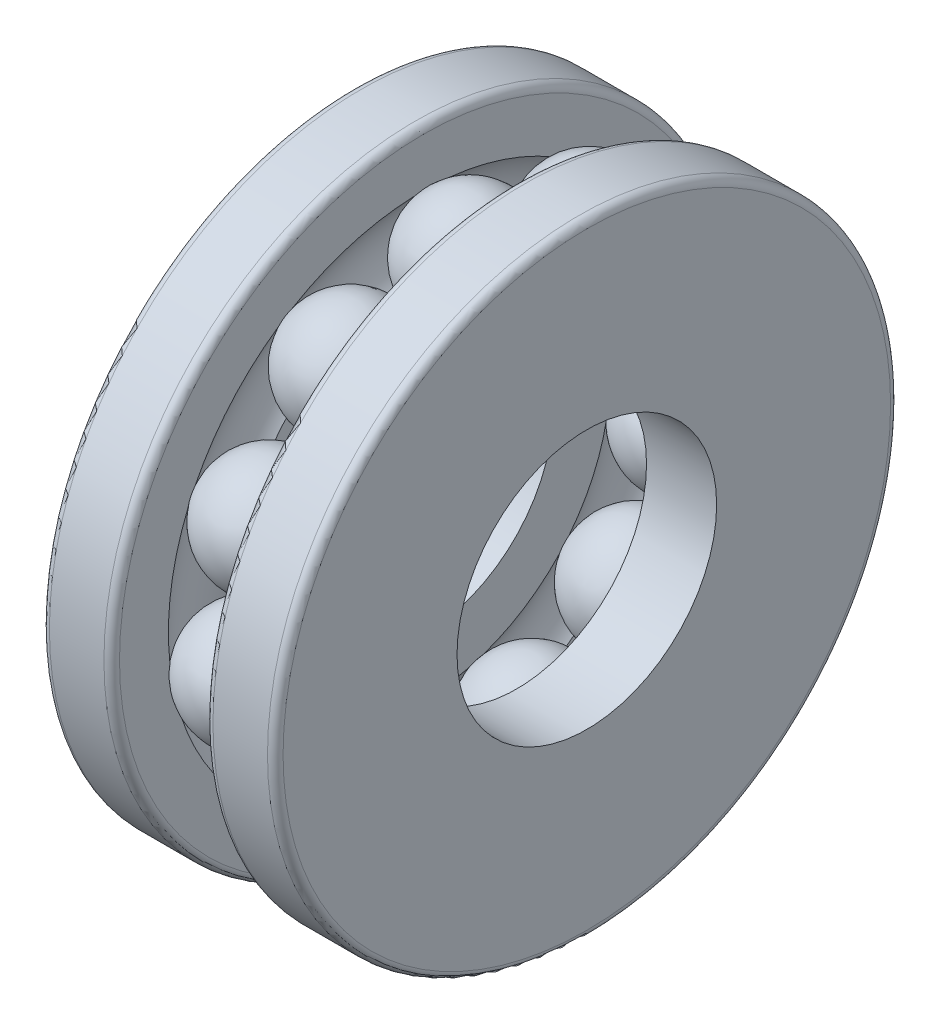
from build123d import *

# Parameters (mm, degrees)
CIRCULAR_PATTERN1_COUNT = 11
FILLET1_R               = 0.3


with BuildPart() as part:
    # Sketch1 → Revolve1 (revolve)
    with BuildSketch(Plane(origin=(0, 0, 0), x_dir=(0, 1, 0), z_dir=(0, 0, 1))):
        with BuildLine():
            Line((6.25, 0), (10.75, 0))
            ThreePointArc((10.75, 0), (8.5, -2.25), (6.25, 0))
        make_face()
    revolve1 = revolve(axis=Axis((0, 4.377607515, 0), (0, 1, 0)))

    # Sketch2 → Revolve2 (revolve)
    with BuildSketch(Plane(origin=(0, 0, 0), x_dir=(0, 1, 0), z_dir=(0, 0, 1)), mode=Mode.PRIVATE) as revolve2_sk:
        with BuildLine():
            Line((5, 4.5), (5, 1.8))
            Line((5, 1.8), (7.183603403, 1.8))
            ThreePointArc((7.183603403, 1.8), (8.5, 2.23), (9.816396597, 1.8))
            Line((9.816396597, 1.8), (12, 1.8))
            Line((12, 1.8), (12, 4.5))
            Line((12, 4.5), (5, 4.5))
        make_face()
    revolve(revolve2_sk.sketch.rotate(Axis((-4.873642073, 0, 0), (1, 0, 0)), 90), axis=Axis((-4.873642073, 0, 0), (1, 0, 0)))

    # Sketch3 → Revolve3 (revolve)
    with BuildSketch(Plane(origin=(0, 0, 0), x_dir=(0, 1, 0), z_dir=(0, 0, 1)), mode=Mode.PRIVATE) as revolve3_sk:
        with BuildLine():
            Line((5, -1.8), (7.183603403, -1.8))
            ThreePointArc((7.183603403, -1.8), (8.5, -2.23), (9.816396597, -1.8))
            Line((9.816396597, -1.8), (12, -1.8))
            Line((12, -1.8), (12, -4.5))
            Line((12, -4.5), (5, -4.5))
            Line((5, -4.5), (5, -1.8))
        make_face()
    revolve(revolve3_sk.sketch.rotate(Axis((-8.725907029, 0, 0), (1, 0, 0)), 90), axis=Axis((-8.725907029, 0, 0), (1, 0, 0)))

    # Circular-Pattern1: Revolve1 ×11 about axis
    circular_pattern1_axis = Axis((0, 0, 0), (1, 0, 0))
    for i in range(1, CIRCULAR_PATTERN1_COUNT):
        add(revolve1.rotate(circular_pattern1_axis, i * 360 / CIRCULAR_PATTERN1_COUNT))

    # Fillet1
    fillet1_edges = [part.edges().sort_by_distance(p)[0] for p in [
        (4.5, 0, -12),
        (1.8, 0, -12),
        (-4.5, 0, -12),
        (-1.8, 0, -12),
    ]]
    fillet(fillet1_edges, radius=FILLET1_R)


solid = part.part
